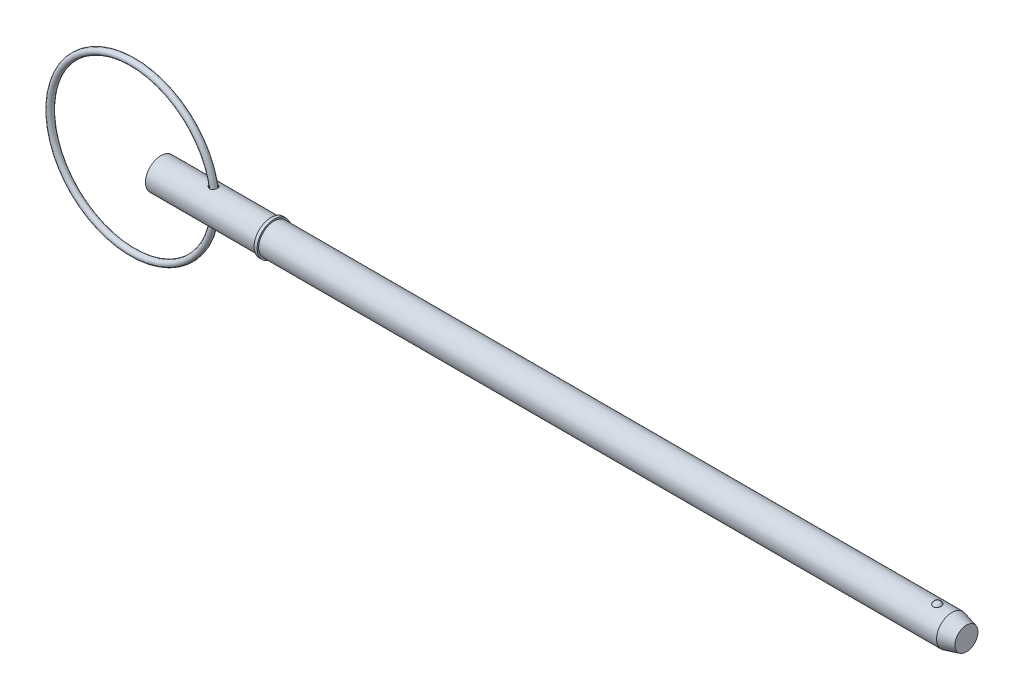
ISO-10303-21;
HEADER;
FILE_DESCRIPTION(('STEP AP214'),'2;1');
FILE_NAME('part.step','',(''),(''),'','','');
FILE_SCHEMA(('AUTOMOTIVE_DESIGN { 1 0 10303 214 1 1 1 1 }'));
ENDSEC;
DATA;
#1=APPLICATION_CONTEXT('core data for automotive mechanical design processes');
#2=APPLICATION_PROTOCOL_DEFINITION('international standard','automotive_design',2000,#1);
#3=PRODUCT_CONTEXT('',#1,'mechanical');
#4=PRODUCT('Part','Part','',(#3));
#5=PRODUCT_RELATED_PRODUCT_CATEGORY('part','',(#4));
#6=PRODUCT_DEFINITION_FORMATION('','',#4);
#7=PRODUCT_DEFINITION_CONTEXT('part definition',#1,'design');
#8=PRODUCT_DEFINITION('design','',#6,#7);
#9=PRODUCT_DEFINITION_SHAPE('','',#8);
#10=(LENGTH_UNIT() NAMED_UNIT(*) SI_UNIT(.MILLI.,.METRE.));
#11=(NAMED_UNIT(*) PLANE_ANGLE_UNIT() SI_UNIT($,.RADIAN.));
#12=(NAMED_UNIT(*) SI_UNIT($,.STERADIAN.) SOLID_ANGLE_UNIT());
#13=UNCERTAINTY_MEASURE_WITH_UNIT(LENGTH_MEASURE(1.E-05),#10,'distance_accuracy_value','');
#14=(GEOMETRIC_REPRESENTATION_CONTEXT(3) GLOBAL_UNCERTAINTY_ASSIGNED_CONTEXT((#13)) GLOBAL_UNIT_ASSIGNED_CONTEXT((#10,
#11,#12)) REPRESENTATION_CONTEXT('',''));
#15=CARTESIAN_POINT('',(0.,0.,0.));
#16=DIRECTION('',(0.,0.,1.));
#17=DIRECTION('',(1.,0.,0.));
#18=AXIS2_PLACEMENT_3D('',#15,#16,#17);
#19=CARTESIAN_POINT('',(-4.3552379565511,0.,0.));
#20=DIRECTION('',(0.,0.,1.));
#21=DIRECTION('',(1.,0.,0.));
#22=AXIS2_PLACEMENT_3D('',#19,#20,#21);
#23=TOROIDAL_SURFACE('',#22,12.7,0.476000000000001);
#24=CARTESIAN_POINT('',(8.8207620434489,0.,0.));
#25=VERTEX_POINT('',#24);
#26=VERTEX_LOOP('',#25);
#27=FACE_BOUND('',#26,.T.);
#28=ADVANCED_FACE('P0_F12',(#27),#23,.T.);
#29=CLOSED_SHELL('',(#28));
#30=MANIFOLD_SOLID_BREP('P0_B1',#29);
#31=CARTESIAN_POINT('',(0.,0.,0.));
#32=DIRECTION('',(1.,0.,0.));
#33=DIRECTION('',(0.,0.,-1.));
#34=AXIS2_PLACEMENT_3D('',#31,#32,#33);
#35=CYLINDRICAL_SURFACE('',#34,2.38);
#36=CARTESIAN_POINT('',(7.58975148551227,2.36313886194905,-0.28279801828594));
#37=CARTESIAN_POINT('',(7.6071494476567,2.3595137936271,-0.313086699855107));
#38=CARTESIAN_POINT('',(7.62722970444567,2.35548219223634,-0.341811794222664));
#39=CARTESIAN_POINT('',(7.6719764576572,2.34708028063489,-0.395416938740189));
#40=CARTESIAN_POINT('',(7.69665038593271,2.34270942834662,-0.420290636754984));
#41=CARTESIAN_POINT('',(7.74972661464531,2.33413422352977,-0.465561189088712));
#42=CARTESIAN_POINT('',(7.77811964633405,2.3299294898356,-0.485968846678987));
#43=CARTESIAN_POINT('',(7.83790446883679,2.32214293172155,-0.521911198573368));
#44=CARTESIAN_POINT('',(7.86929545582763,2.31856094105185,-0.537447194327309));
#45=CARTESIAN_POINT('',(7.93519088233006,2.31234960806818,-0.563583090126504));
#46=CARTESIAN_POINT('',(7.96975762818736,2.30974952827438,-0.574033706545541));
#47=CARTESIAN_POINT('',(8.04024488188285,2.3060008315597,-0.588914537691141));
#48=CARTESIAN_POINT('',(8.07616512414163,2.3048519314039,-0.593345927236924));
#49=CARTESIAN_POINT('',(8.14695871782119,2.30420789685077,-0.595841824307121));
#50=CARTESIAN_POINT('',(8.18182355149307,2.30465507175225,-0.594128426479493));
#51=CARTESIAN_POINT('',(8.25068512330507,2.30705630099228,-0.584734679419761));
#52=CARTESIAN_POINT('',(8.28468213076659,2.30900988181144,-0.577056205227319));
#53=CARTESIAN_POINT('',(8.34906698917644,2.31406811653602,-0.556412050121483));
#54=CARTESIAN_POINT('',(8.37955021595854,2.31711087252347,-0.543727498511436));
#55=CARTESIAN_POINT('',(8.43786372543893,2.32400968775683,-0.513438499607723));
#56=CARTESIAN_POINT('',(8.46569411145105,2.32786571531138,-0.495834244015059));
#57=CARTESIAN_POINT('',(8.51768626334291,2.33591620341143,-0.456393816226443));
#58=CARTESIAN_POINT('',(8.54188060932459,2.34010706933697,-0.434599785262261));
#59=CARTESIAN_POINT('',(8.58630752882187,2.34840208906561,-0.387277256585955));
#60=CARTESIAN_POINT('',(8.60653982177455,2.35250623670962,-0.361748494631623));
#61=CARTESIAN_POINT('',(8.64282785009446,2.36024850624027,-0.307237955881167));
#62=CARTESIAN_POINT('',(8.65881497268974,2.36387854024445,-0.278209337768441));
#63=CARTESIAN_POINT('',(8.68580879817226,2.37020506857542,-0.217827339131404));
#64=CARTESIAN_POINT('',(8.69681534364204,2.37290153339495,-0.18647388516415));
#65=CARTESIAN_POINT('',(8.71363969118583,2.37708738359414,-0.122079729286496));
#66=CARTESIAN_POINT('',(8.71941899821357,2.37856780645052,-0.0890283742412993));
#67=CARTESIAN_POINT('',(8.72550469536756,2.38012793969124,-0.0223933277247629));
#68=CARTESIAN_POINT('',(8.72581115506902,2.38020766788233,0.0111903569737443));
#69=CARTESIAN_POINT('',(8.72094957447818,2.37895941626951,0.0778527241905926));
#70=CARTESIAN_POINT('',(8.71579439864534,2.377634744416,0.110932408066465));
#71=CARTESIAN_POINT('',(8.70015845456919,2.37372548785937,0.175731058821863));
#72=CARTESIAN_POINT('',(8.68967753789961,2.37114086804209,0.207449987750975));
#73=CARTESIAN_POINT('',(8.66363496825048,2.36498751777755,0.268667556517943));
#74=CARTESIAN_POINT('',(8.64806773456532,2.36141770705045,0.298163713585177));
#75=CARTESIAN_POINT('',(8.61223946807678,2.35368505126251,0.354067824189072));
#76=CARTESIAN_POINT('',(8.59197833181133,2.34952219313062,0.380475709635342));
#77=CARTESIAN_POINT('',(8.54726357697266,2.34106443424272,0.429460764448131));
#78=CARTESIAN_POINT('',(8.52280850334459,2.33676948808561,0.452036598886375));
#79=CARTESIAN_POINT('',(8.47035669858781,2.3285376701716,0.49269040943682));
#80=CARTESIAN_POINT('',(8.44236041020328,2.32460075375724,0.510768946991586));
#81=CARTESIAN_POINT('',(8.38398546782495,2.31758529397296,0.541708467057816));
#82=CARTESIAN_POINT('',(8.35364184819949,2.31449641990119,0.554633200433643));
#83=CARTESIAN_POINT('',(8.29114127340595,2.30945817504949,0.575253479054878));
#84=CARTESIAN_POINT('',(8.25898451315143,2.30750868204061,0.582949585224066));
#85=CARTESIAN_POINT('',(8.19412910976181,2.30496641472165,0.592921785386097));
#86=CARTESIAN_POINT('',(8.161439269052,2.30436008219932,0.595252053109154));
#87=CARTESIAN_POINT('',(8.09610955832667,2.30450130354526,0.594704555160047));
#88=CARTESIAN_POINT('',(8.0634696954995,2.30524903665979,0.591826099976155));
#89=CARTESIAN_POINT('',(7.99825736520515,2.30802121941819,0.580921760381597));
#90=CARTESIAN_POINT('',(7.96570822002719,2.31007800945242,0.572765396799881));
#91=CARTESIAN_POINT('',(7.90235775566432,2.31524655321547,0.551500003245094));
#92=CARTESIAN_POINT('',(7.87155698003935,2.31835863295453,0.53838944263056));
#93=CARTESIAN_POINT('',(7.81084906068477,2.32548378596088,0.506755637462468));
#94=CARTESIAN_POINT('',(7.78107737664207,2.32953608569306,0.487980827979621));
#95=CARTESIAN_POINT('',(7.72506412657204,2.33797565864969,0.445793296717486));
#96=CARTESIAN_POINT('',(7.69882353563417,2.34236302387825,0.422379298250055));
#97=CARTESIAN_POINT('',(7.65019002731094,2.35106473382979,0.370927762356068));
#98=CARTESIAN_POINT('',(7.62788209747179,2.35537598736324,0.342808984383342));
#99=CARTESIAN_POINT('',(7.58861130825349,2.36331071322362,0.282967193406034));
#100=CARTESIAN_POINT('',(7.57164595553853,2.3669345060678,0.251245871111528));
#101=CARTESIAN_POINT('',(7.54465876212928,2.37284705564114,0.187017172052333));
#102=CARTESIAN_POINT('',(7.5342924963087,2.37520082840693,0.154660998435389));
#103=CARTESIAN_POINT('',(7.51954252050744,2.37858198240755,0.0885446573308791));
#104=CARTESIAN_POINT('',(7.51515589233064,2.37961001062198,0.0547851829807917));
#105=CARTESIAN_POINT('',(7.51270681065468,2.38018226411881,-0.0102367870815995));
#106=CARTESIAN_POINT('',(7.51416323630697,2.37983937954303,-0.0414812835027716));
#107=CARTESIAN_POINT('',(7.52225907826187,2.37796025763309,-0.103234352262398));
#108=CARTESIAN_POINT('',(7.52889419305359,2.37642501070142,-0.133743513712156));
#109=CARTESIAN_POINT('',(7.54430841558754,2.37294751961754,-0.184277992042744));
#110=CARTESIAN_POINT('',(7.55185254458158,2.37126438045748,-0.204709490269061));
#111=CARTESIAN_POINT('',(7.56916989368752,2.36748607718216,-0.244561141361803));
#112=CARTESIAN_POINT('',(7.57894307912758,2.36539091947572,-0.263981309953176));
#113=CARTESIAN_POINT('',(7.58975148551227,2.36313886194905,-0.28279801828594));
#114=B_SPLINE_CURVE_WITH_KNOTS('',3,(#36,#37,#38,#39,#40,#41,#42,#43,#44,#45,#46,#47,#48,#49,
#50,#51,#52,#53,#54,#55,#56,#57,#58,#59,#60,#61,#62,#63,#64,#65,#66,#67,#68,#69,#70,#71,#72,#73,
#74,#75,#76,#77,#78,#79,#80,#81,#82,#83,#84,#85,#86,#87,#88,#89,#90,#91,#92,#93,#94,#95,#96,#97,
#98,#99,#100,#101,#102,#103,#104,#105,#106,#107,#108,#109,#110,#111,#112,#113),.UNSPECIFIED.,
.T.,.F.,(4,2,2,2,2,2,2,2,2,2,2,2,2,2,2,2,2,2,2,2,2,2,2,2,2,2,2,2,2,2,2,2,2,2,2,2,2,2,4),(0.,
0.105267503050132,0.210706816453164,0.315888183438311,0.421041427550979,0.529118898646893,
0.637175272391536,0.741366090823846,0.84552417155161,0.944516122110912,1.04350421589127,
1.14154435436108,1.23959143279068,1.33913812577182,1.43868796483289,1.53896508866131,
1.63924093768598,1.73928111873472,1.83932408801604,1.93947719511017,2.03963250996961,
2.13982264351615,2.24000026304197,2.33889712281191,2.43778337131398,2.53566679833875,
2.63356318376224,2.73397729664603,2.83442245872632,2.94022921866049,3.04606513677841,
3.15396441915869,3.26181327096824,3.36343346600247,3.46500405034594,3.55839004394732,
3.65169855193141,3.71709653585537,3.78249350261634),.UNSPECIFIED.);
#115=CARTESIAN_POINT('',(7.58975148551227,2.36313886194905,-0.28279801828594));
#116=VERTEX_POINT('',#115);
#117=EDGE_CURVE('P1_E42',#116,#116,#114,.T.);
#118=ORIENTED_EDGE('',*,*,#117,.T.);
#119=EDGE_LOOP('',(#118));
#120=FACE_BOUND('',#119,.T.);
#121=CARTESIAN_POINT('',(0.,0.,0.));
#122=DIRECTION('',(1.,0.,0.));
#123=DIRECTION('',(0.,0.,-1.));
#124=AXIS2_PLACEMENT_3D('',#121,#122,#123);
#125=CIRCLE('',#124,2.38);
#126=CARTESIAN_POINT('',(0.,0.,-2.38));
#127=VERTEX_POINT('',#126);
#128=EDGE_CURVE('P1_E9',#127,#127,#125,.T.);
#129=ORIENTED_EDGE('',*,*,#128,.T.);
#130=EDGE_LOOP('',(#129));
#131=FACE_BOUND('',#130,.T.);
#132=CARTESIAN_POINT('',(16.974,0.,0.));
#133=DIRECTION('',(1.,0.,0.));
#134=DIRECTION('',(0.,0.,-1.));
#135=AXIS2_PLACEMENT_3D('',#132,#133,#134);
#136=CIRCLE('',#135,2.38);
#137=CARTESIAN_POINT('',(16.974,0.,-2.38));
#138=VERTEX_POINT('',#137);
#139=EDGE_CURVE('P1_E25',#138,#138,#136,.T.);
#140=ORIENTED_EDGE('',*,*,#139,.F.);
#141=EDGE_LOOP('',(#140));
#142=FACE_BOUND('',#141,.T.);
#143=CARTESIAN_POINT('',(7.58975148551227,-2.36313886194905,-0.28279801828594));
#144=CARTESIAN_POINT('',(7.57418830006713,-2.3663814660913,-0.255701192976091));
#145=CARTESIAN_POINT('',(7.56076205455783,-2.36930044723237,-0.227336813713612));
#146=CARTESIAN_POINT('',(7.53869583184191,-2.37419355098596,-0.168724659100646));
#147=CARTESIAN_POINT('',(7.53005409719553,-2.37616802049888,-0.138477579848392));
#148=CARTESIAN_POINT('',(7.5179268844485,-2.37895970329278,-0.0768369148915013));
#149=CARTESIAN_POINT('',(7.51445304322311,-2.37977430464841,-0.0454409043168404));
#150=CARTESIAN_POINT('',(7.51287156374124,-2.38014365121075,0.0174935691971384));
#151=CARTESIAN_POINT('',(7.51476360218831,-2.37969847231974,0.0490320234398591));
#152=CARTESIAN_POINT('',(7.52368198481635,-2.37763188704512,0.11036883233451));
#153=CARTESIAN_POINT('',(7.53055435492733,-2.37604576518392,0.140191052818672));
#154=CARTESIAN_POINT('',(7.54895588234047,-2.37190466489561,0.19828599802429));
#155=CARTESIAN_POINT('',(7.56048572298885,-2.36934954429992,0.226558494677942));
#156=CARTESIAN_POINT('',(7.58819257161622,-2.36343089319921,0.281762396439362));
#157=CARTESIAN_POINT('',(7.60450508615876,-2.36004434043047,0.308623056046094));
#158=CARTESIAN_POINT('',(7.64106334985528,-2.35283977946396,0.359451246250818));
#159=CARTESIAN_POINT('',(7.6613104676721,-2.34902162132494,0.383417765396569));
#160=CARTESIAN_POINT('',(7.70695754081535,-2.34099193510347,0.429832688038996));
#161=CARTESIAN_POINT('',(7.73264232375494,-2.33677362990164,0.45200004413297));
#162=CARTESIAN_POINT('',(7.78725305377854,-2.32868304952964,0.491988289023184));
#163=CARTESIAN_POINT('',(7.81618023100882,-2.32481090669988,0.509807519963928));
#164=CARTESIAN_POINT('',(7.87824201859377,-2.31763132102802,0.541539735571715));
#165=CARTESIAN_POINT('',(7.91152093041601,-2.31436703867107,0.555181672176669));
#166=CARTESIAN_POINT('',(7.97999150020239,-2.30909873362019,0.576703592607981));
#167=CARTESIAN_POINT('',(8.01518292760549,-2.30709455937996,0.584584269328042));
#168=CARTESIAN_POINT('',(8.08580757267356,-2.30465743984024,0.594119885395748));
#169=CARTESIAN_POINT('',(8.12122470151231,-2.30419653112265,0.595885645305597));
#170=CARTESIAN_POINT('',(8.19181659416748,-2.30486796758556,0.593284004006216));
#171=CARTESIAN_POINT('',(8.22699144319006,-2.30599972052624,0.588918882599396));
#172=CARTESIAN_POINT('',(8.29408987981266,-2.30963941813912,0.574470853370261));
#173=CARTESIAN_POINT('',(8.32608666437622,-2.31207030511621,0.564707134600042));
#174=CARTESIAN_POINT('',(8.38787213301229,-2.31798180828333,0.539927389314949));
#175=CARTESIAN_POINT('',(8.41766103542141,-2.32146232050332,0.524911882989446));
#176=CARTESIAN_POINT('',(8.47353661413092,-2.32898511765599,0.490439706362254));
#177=CARTESIAN_POINT('',(8.49969091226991,-2.33301318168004,0.471089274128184));
#178=CARTESIAN_POINT('',(8.54838372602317,-2.34124455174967,0.428307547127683));
#179=CARTESIAN_POINT('',(8.57092204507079,-2.34544786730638,0.404876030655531));
#180=CARTESIAN_POINT('',(8.61207557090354,-2.35362667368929,0.354267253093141));
#181=CARTESIAN_POINT('',(8.63063940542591,-2.35759874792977,0.3270476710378));
#182=CARTESIAN_POINT('',(8.66303816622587,-2.36482918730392,0.269839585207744));
#183=CARTESIAN_POINT('',(8.67687284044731,-2.36808751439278,0.23985093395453));
#184=CARTESIAN_POINT('',(8.69960621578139,-2.37357381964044,0.177579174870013));
#185=CARTESIAN_POINT('',(8.7084473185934,-2.3757897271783,0.145273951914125));
#186=CARTESIAN_POINT('',(8.72072898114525,-2.37889592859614,0.0795911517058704));
#187=CARTESIAN_POINT('',(8.72416959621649,-2.37978623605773,0.0462135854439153));
#188=CARTESIAN_POINT('',(8.72556332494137,-2.38014500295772,-0.0206284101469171));
#189=CARTESIAN_POINT('',(8.72352221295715,-2.37961495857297,-0.0540927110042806));
#190=CARTESIAN_POINT('',(8.71401607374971,-2.37719332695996,-0.12019135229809));
#191=CARTESIAN_POINT('',(8.70655097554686,-2.37530172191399,-0.152825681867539));
#192=CARTESIAN_POINT('',(8.68638818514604,-2.37036240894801,-0.216324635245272));
#193=CARTESIAN_POINT('',(8.67369312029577,-2.36731528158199,-0.247190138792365));
#194=CARTESIAN_POINT('',(8.64338307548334,-2.36039503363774,-0.306303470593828));
#195=CARTESIAN_POINT('',(8.62576790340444,-2.35652188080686,-0.334551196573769));
#196=CARTESIAN_POINT('',(8.58601062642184,-2.34836581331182,-0.387689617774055));
#197=CARTESIAN_POINT('',(8.56385884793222,-2.34408203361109,-0.412572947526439));
#198=CARTESIAN_POINT('',(8.51562034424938,-2.33559361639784,-0.458194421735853));
#199=CARTESIAN_POINT('',(8.4895339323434,-2.33138897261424,-0.478932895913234));
#200=CARTESIAN_POINT('',(8.43437902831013,-2.32357677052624,-0.515498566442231));
#201=CARTESIAN_POINT('',(8.40533919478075,-2.31996422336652,-0.531367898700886));
#202=CARTESIAN_POINT('',(8.3449114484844,-2.31370413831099,-0.557997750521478));
#203=CARTESIAN_POINT('',(8.31352388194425,-2.31105645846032,-0.568759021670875));
#204=CARTESIAN_POINT('',(8.24979053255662,-2.30704987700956,-0.584798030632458));
#205=CARTESIAN_POINT('',(8.2174653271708,-2.30567279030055,-0.590153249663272));
#206=CARTESIAN_POINT('',(8.15234941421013,-2.3042717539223,-0.595600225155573));
#207=CARTESIAN_POINT('',(8.11955868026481,-2.30424788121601,-0.595691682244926));
#208=CARTESIAN_POINT('',(8.05396041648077,-2.30553291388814,-0.590698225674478));
#209=CARTESIAN_POINT('',(8.02115865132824,-2.30685983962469,-0.585543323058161));
#210=CARTESIAN_POINT('',(7.95682322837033,-2.31069752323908,-0.570209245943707));
#211=CARTESIAN_POINT('',(7.9252899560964,-2.31320863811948,-0.560028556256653));
#212=CARTESIAN_POINT('',(7.86270639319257,-2.31927991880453,-0.534343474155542));
#213=CARTESIAN_POINT('',(7.83175966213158,-2.32288638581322,-0.51859766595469));
#214=CARTESIAN_POINT('',(7.7728658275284,-2.33068292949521,-0.48234820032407));
#215=CARTESIAN_POINT('',(7.74491930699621,-2.33487311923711,-0.461843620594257));
#216=CARTESIAN_POINT('',(7.69322838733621,-2.34330635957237,-0.416926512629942));
#217=CARTESIAN_POINT('',(7.66941974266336,-2.34754724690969,-0.392587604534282));
#218=CARTESIAN_POINT('',(7.62614930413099,-2.35569931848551,-0.340264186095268));
#219=CARTESIAN_POINT('',(7.60668542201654,-2.35961066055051,-0.312281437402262));
#220=CARTESIAN_POINT('',(7.58975148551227,-2.36313886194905,-0.28279801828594));
#221=B_SPLINE_CURVE_WITH_KNOTS('',3,(#143,#144,#145,#146,#147,#148,#149,#150,#151,#152,#153,
#154,#155,#156,#157,#158,#159,#160,#161,#162,#163,#164,#165,#166,#167,#168,#169,#170,#171,#172,
#173,#174,#175,#176,#177,#178,#179,#180,#181,#182,#183,#184,#185,#186,#187,#188,#189,#190,#191,
#192,#193,#194,#195,#196,#197,#198,#199,#200,#201,#202,#203,#204,#205,#206,#207,#208,#209,#210,
#211,#212,#213,#214,#215,#216,#217,#218,#219,#220),.UNSPECIFIED.,.T.,.F.,(4,2,2,2,2,2,2,2,2,2,2,
2,2,2,2,2,2,2,2,2,2,2,2,2,2,2,2,2,2,2,2,2,2,2,2,2,2,2,4),(0.,0.0941407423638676,
0.188246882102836,0.282564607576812,0.376876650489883,0.468390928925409,0.559918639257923,
0.654342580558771,0.748799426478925,0.850921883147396,0.953083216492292,1.06090345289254,
1.16871071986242,1.2745536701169,1.38035727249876,1.48048681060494,1.58060643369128,
1.67849861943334,1.7763961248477,1.87549138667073,1.97459192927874,2.07481335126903,
2.17503374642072,2.27514861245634,2.37526478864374,2.47533073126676,2.57540058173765,
2.67568607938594,2.77596359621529,2.87534713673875,2.97471604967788,3.07263964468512,
3.17056880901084,3.26982174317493,3.36910461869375,3.47336737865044,3.57765036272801,
3.68013205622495,3.78256438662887),.UNSPECIFIED.);
#222=CARTESIAN_POINT('',(7.58975148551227,-2.36313886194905,-0.28279801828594));
#223=VERTEX_POINT('',#222);
#224=EDGE_CURVE('P1_E17',#223,#223,#221,.T.);
#225=ORIENTED_EDGE('',*,*,#224,.T.);
#226=EDGE_LOOP('',(#225));
#227=FACE_BOUND('',#226,.T.);
#228=ADVANCED_FACE('P1_F13',(#120,#131,#142,#227),#35,.T.);
#229=CARTESIAN_POINT('',(0.,0.,0.));
#230=DIRECTION('',(1.,0.,0.));
#231=DIRECTION('',(0.,0.,-1.));
#232=AXIS2_PLACEMENT_3D('',#229,#230,#231);
#233=CYLINDRICAL_SURFACE('',#232,2.38);
#234=CARTESIAN_POINT('',(121.909429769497,0.,0.));
#235=DIRECTION('',(1.,0.,0.));
#236=DIRECTION('',(0.,0.,-1.));
#237=AXIS2_PLACEMENT_3D('',#234,#235,#236);
#238=CIRCLE('',#237,2.38);
#239=CARTESIAN_POINT('',(121.909429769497,0.,-2.38));
#240=VERTEX_POINT('',#239);
#241=EDGE_CURVE('P1_E99',#240,#240,#238,.T.);
#242=ORIENTED_EDGE('',*,*,#241,.F.);
#243=EDGE_LOOP('',(#242));
#244=FACE_BOUND('',#243,.T.);
#245=CARTESIAN_POINT('',(17.45,0.,0.));
#246=DIRECTION('',(1.,0.,0.));
#247=DIRECTION('',(0.,0.,-1.));
#248=AXIS2_PLACEMENT_3D('',#245,#246,#247);
#249=CIRCLE('',#248,2.38);
#250=CARTESIAN_POINT('',(17.45,0.,-2.38));
#251=VERTEX_POINT('',#250);
#252=EDGE_CURVE('P1_E96',#251,#251,#249,.T.);
#253=ORIENTED_EDGE('',*,*,#252,.T.);
#254=EDGE_LOOP('',(#253));
#255=FACE_BOUND('',#254,.T.);
#256=CARTESIAN_POINT('',(119.663449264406,2.2921568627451,0.640637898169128));
#257=CARTESIAN_POINT('',(119.630355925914,2.29215737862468,0.640637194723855));
#258=CARTESIAN_POINT('',(119.597254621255,2.29293179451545,0.637884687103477));
#259=CARTESIAN_POINT('',(119.532017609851,2.29594030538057,0.626968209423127));
#260=CARTESIAN_POINT('',(119.499882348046,2.29817506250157,0.618801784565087));
#261=CARTESIAN_POINT('',(119.437540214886,2.30384308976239,0.597351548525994));
#262=CARTESIAN_POINT('',(119.40733051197,2.30727454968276,0.584075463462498));
#263=CARTESIAN_POINT('',(119.349567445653,2.31495941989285,0.552829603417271));
#264=CARTESIAN_POINT('',(119.32201418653,2.31921286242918,0.534859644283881));
#265=CARTESIAN_POINT('',(119.269593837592,2.32820213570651,0.494282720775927));
#266=CARTESIAN_POINT('',(119.244805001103,2.33294694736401,0.471576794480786));
#267=CARTESIAN_POINT('',(119.199216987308,2.34234144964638,0.422446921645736));
#268=CARTESIAN_POINT('',(119.178418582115,2.34699112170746,0.396022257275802));
#269=CARTESIAN_POINT('',(119.14035804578,2.35593942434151,0.338855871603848));
#270=CARTESIAN_POINT('',(119.123305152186,2.36021170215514,0.307970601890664));
#271=CARTESIAN_POINT('',(119.0943607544,2.3677057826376,0.243750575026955));
#272=CARTESIAN_POINT('',(119.0824701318,2.37092740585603,0.210415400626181));
#273=CARTESIAN_POINT('',(119.063807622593,2.37606901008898,0.141189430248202));
#274=CARTESIAN_POINT('',(119.057195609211,2.37794816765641,0.105252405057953));
#275=CARTESIAN_POINT('',(119.049809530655,2.38005135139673,0.0327351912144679));
#276=CARTESIAN_POINT('',(119.049035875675,2.38027526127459,-0.00384504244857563));
#277=CARTESIAN_POINT('',(119.053362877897,2.37903842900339,-0.076983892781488));
#278=CARTESIAN_POINT('',(119.05852028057,2.37756141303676,-0.113538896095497));
#279=CARTESIAN_POINT('',(119.074701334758,2.37305303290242,-0.185229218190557));
#280=CARTESIAN_POINT('',(119.085725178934,2.37002161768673,-0.220364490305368));
#281=CARTESIAN_POINT('',(119.113397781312,2.36273722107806,-0.288156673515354));
#282=CARTESIAN_POINT('',(119.130038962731,2.35848588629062,-0.320816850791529));
#283=CARTESIAN_POINT('',(119.168598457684,2.34923130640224,-0.382744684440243));
#284=CARTESIAN_POINT('',(119.190516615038,2.34422808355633,-0.412012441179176));
#285=CARTESIAN_POINT('',(119.238754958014,2.33412555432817,-0.46583000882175));
#286=CARTESIAN_POINT('',(119.265002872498,2.32902887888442,-0.490444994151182));
#287=CARTESIAN_POINT('',(119.321476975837,2.31926941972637,-0.534700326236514));
#288=CARTESIAN_POINT('',(119.351702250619,2.3146065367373,-0.554341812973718));
#289=CARTESIAN_POINT('',(119.414061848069,2.30645675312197,-0.587312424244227));
#290=CARTESIAN_POINT('',(119.446078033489,2.30293152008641,-0.600855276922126));
#291=CARTESIAN_POINT('',(119.512079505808,2.29725171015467,-0.622220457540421));
#292=CARTESIAN_POINT('',(119.546064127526,2.29509667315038,-0.630044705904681));
#293=CARTESIAN_POINT('',(119.613299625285,2.29249264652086,-0.639452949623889));
#294=CARTESIAN_POINT('',(119.646508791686,2.29196755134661,-0.641315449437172));
#295=CARTESIAN_POINT('',(119.712763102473,2.29246849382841,-0.639522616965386));
#296=CARTESIAN_POINT('',(119.745808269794,2.29349430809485,-0.635868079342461));
#297=CARTESIAN_POINT('',(119.810102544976,2.29694059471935,-0.623301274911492));
#298=CARTESIAN_POINT('',(119.841374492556,2.29933234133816,-0.61449721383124));
#299=CARTESIAN_POINT('',(119.901995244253,2.30522511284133,-0.592006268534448));
#300=CARTESIAN_POINT('',(119.931343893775,2.30872622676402,-0.57831899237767));
#301=CARTESIAN_POINT('',(119.988036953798,2.31655795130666,-0.546112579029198));
#302=CARTESIAN_POINT('',(120.015320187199,2.32090569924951,-0.527490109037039));
#303=CARTESIAN_POINT('',(120.066490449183,2.32992206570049,-0.48611785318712));
#304=CARTESIAN_POINT('',(120.090376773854,2.33459075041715,-0.46336721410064));
#305=CARTESIAN_POINT('',(120.135272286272,2.34399834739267,-0.413220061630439));
#306=CARTESIAN_POINT('',(120.156097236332,2.34873051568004,-0.385657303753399));
#307=CARTESIAN_POINT('',(120.193056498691,2.35754932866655,-0.327455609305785));
#308=CARTESIAN_POINT('',(120.209189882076,2.36163584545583,-0.296816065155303));
#309=CARTESIAN_POINT('',(120.2369822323,2.36889321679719,-0.232047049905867));
#310=CARTESIAN_POINT('',(120.248445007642,2.37202275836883,-0.197828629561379));
#311=CARTESIAN_POINT('',(120.265752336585,2.37681926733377,-0.12790042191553));
#312=CARTESIAN_POINT('',(120.271596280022,2.37848607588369,-0.0921904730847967));
#313=CARTESIAN_POINT('',(120.277605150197,2.38020024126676,-0.0196348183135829));
#314=CARTESIAN_POINT('',(120.27767043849,2.38021918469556,0.0172198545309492));
#315=CARTESIAN_POINT('',(120.271868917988,2.37856356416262,0.0904219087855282));
#316=CARTESIAN_POINT('',(120.266001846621,2.37688892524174,0.126769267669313));
#317=CARTESIAN_POINT('',(120.248425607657,2.37201688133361,0.19802859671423));
#318=CARTESIAN_POINT('',(120.236699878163,2.36881516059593,0.232936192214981));
#319=CARTESIAN_POINT('',(120.20763544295,2.36123444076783,0.300196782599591));
#320=CARTESIAN_POINT('',(120.190296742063,2.3568554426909,0.332549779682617));
#321=CARTESIAN_POINT('',(120.150535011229,2.34744667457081,0.393495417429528));
#322=CARTESIAN_POINT('',(120.128152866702,2.34242227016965,0.422115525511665));
#323=CARTESIAN_POINT('',(120.078739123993,2.33227293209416,0.475004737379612));
#324=CARTESIAN_POINT('',(120.051707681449,2.32714800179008,0.499273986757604));
#325=CARTESIAN_POINT('',(119.994498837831,2.31755359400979,0.542046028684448));
#326=CARTESIAN_POINT('',(119.96442973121,2.31306986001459,0.560690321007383));
#327=CARTESIAN_POINT('',(119.901386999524,2.3051412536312,0.592447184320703));
#328=CARTESIAN_POINT('',(119.868415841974,2.30169550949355,0.605564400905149));
#329=CARTESIAN_POINT('',(119.806842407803,2.29677744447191,0.623927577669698));
#330=CARTESIAN_POINT('',(119.778555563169,2.29505839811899,0.630178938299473));
#331=CARTESIAN_POINT('',(119.721330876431,2.29274795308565,0.638534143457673));
#332=CARTESIAN_POINT('',(119.692393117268,2.29215641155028,0.64063851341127));
#333=CARTESIAN_POINT('',(119.663449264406,2.2921568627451,0.640637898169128));
#334=B_SPLINE_CURVE_WITH_KNOTS('',3,(#256,#257,#258,#259,#260,#261,#262,#263,#264,#265,#266,
#267,#268,#269,#270,#271,#272,#273,#274,#275,#276,#277,#278,#279,#280,#281,#282,#283,#284,#285,
#286,#287,#288,#289,#290,#291,#292,#293,#294,#295,#296,#297,#298,#299,#300,#301,#302,#303,#304,
#305,#306,#307,#308,#309,#310,#311,#312,#313,#314,#315,#316,#317,#318,#319,#320,#321,#322,#323,
#324,#325,#326,#327,#328,#329,#330,#331,#332,#333),.UNSPECIFIED.,.T.,.F.,(4,2,2,2,2,2,2,2,2,2,2,
2,2,2,2,2,2,2,2,2,2,2,2,2,2,2,2,2,2,2,2,2,2,2,2,2,2,2,4),(0.,0.0991724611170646,
0.198389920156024,0.297457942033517,0.396529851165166,0.497927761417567,0.599345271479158,
0.705475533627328,0.811623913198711,0.92087671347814,1.03013718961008,1.1404517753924,
1.25076998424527,1.3609399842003,1.47110672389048,1.57959248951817,1.68805336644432,
1.79234266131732,1.89659691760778,1.99590391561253,2.0951966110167,2.19247425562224,
2.28975970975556,2.38926978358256,2.48880044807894,2.5929358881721,2.69709193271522,
2.80525821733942,2.91343624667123,3.02347917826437,3.13352698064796,3.24388765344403,
3.35424823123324,3.46374443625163,3.57323697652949,3.67968690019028,3.78604717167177,
3.87279565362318,3.9595331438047),.UNSPECIFIED.);
#335=CARTESIAN_POINT('',(119.663449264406,2.2921568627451,0.640637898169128));
#336=VERTEX_POINT('',#335);
#337=EDGE_CURVE('P1_E34',#336,#336,#334,.T.);
#338=ORIENTED_EDGE('',*,*,#337,.T.);
#339=EDGE_LOOP('',(#338));
#340=FACE_BOUND('',#339,.T.);
#341=ADVANCED_FACE('P1_F46',(#244,#255,#340),#233,.T.);
#342=CARTESIAN_POINT('',(0.,0.,0.));
#343=DIRECTION('',(-1.,0.,0.));
#344=DIRECTION('',(0.,0.,1.));
#345=AXIS2_PLACEMENT_3D('',#342,#343,#344);
#346=PLANE('',#345);
#347=ORIENTED_EDGE('',*,*,#128,.F.);
#348=EDGE_LOOP('',(#347));
#349=FACE_BOUND('',#348,.T.);
#350=ADVANCED_FACE('P1_F15',(#349),#346,.T.);
#351=CARTESIAN_POINT('',(16.974,2.38,0.));
#352=DIRECTION('',(-1.,0.,0.));
#353=DIRECTION('',(0.,0.,1.));
#354=AXIS2_PLACEMENT_3D('',#351,#352,#353);
#355=PLANE('',#354);
#356=ORIENTED_EDGE('',*,*,#139,.T.);
#357=EDGE_LOOP('',(#356));
#358=FACE_BOUND('',#357,.T.);
#359=CARTESIAN_POINT('',(16.974,0.,0.));
#360=DIRECTION('',(1.,0.,0.));
#361=DIRECTION('',(0.,0.,-1.));
#362=AXIS2_PLACEMENT_3D('',#359,#360,#361);
#363=CIRCLE('',#362,2.618);
#364=CARTESIAN_POINT('',(16.974,0.,-2.618));
#365=VERTEX_POINT('',#364);
#366=EDGE_CURVE('P1_E30',#365,#365,#363,.T.);
#367=ORIENTED_EDGE('',*,*,#366,.F.);
#368=EDGE_LOOP('',(#367));
#369=FACE_BOUND('',#368,.T.);
#370=ADVANCED_FACE('P1_F81',(#358,#369),#355,.T.);
#371=CARTESIAN_POINT('',(0.,0.,0.));
#372=DIRECTION('',(1.,0.,0.));
#373=DIRECTION('',(0.,0.,-1.));
#374=AXIS2_PLACEMENT_3D('',#371,#372,#373);
#375=CYLINDRICAL_SURFACE('',#374,2.618);
#376=ORIENTED_EDGE('',*,*,#366,.T.);
#377=EDGE_LOOP('',(#376));
#378=FACE_BOUND('',#377,.T.);
#379=CARTESIAN_POINT('',(17.45,0.,0.));
#380=DIRECTION('',(1.,0.,0.));
#381=DIRECTION('',(0.,0.,-1.));
#382=AXIS2_PLACEMENT_3D('',#379,#380,#381);
#383=CIRCLE('',#382,2.618);
#384=CARTESIAN_POINT('',(17.45,0.,-2.618));
#385=VERTEX_POINT('',#384);
#386=EDGE_CURVE('P1_E95',#385,#385,#383,.T.);
#387=ORIENTED_EDGE('',*,*,#386,.F.);
#388=EDGE_LOOP('',(#387));
#389=FACE_BOUND('',#388,.T.);
#390=ADVANCED_FACE('P1_F68',(#378,#389),#375,.T.);
#391=CARTESIAN_POINT('',(17.45,2.618,0.));
#392=DIRECTION('',(1.,0.,0.));
#393=DIRECTION('',(0.,0.,-1.));
#394=AXIS2_PLACEMENT_3D('',#391,#392,#393);
#395=PLANE('',#394);
#396=ORIENTED_EDGE('',*,*,#386,.T.);
#397=EDGE_LOOP('',(#396));
#398=FACE_BOUND('',#397,.T.);
#399=ORIENTED_EDGE('',*,*,#252,.F.);
#400=EDGE_LOOP('',(#399));
#401=FACE_BOUND('',#400,.T.);
#402=ADVANCED_FACE('P1_F62',(#398,#401),#395,.T.);
#403=CARTESIAN_POINT('',(124.13,0.,0.));
#404=DIRECTION('',(-1.,0.,0.));
#405=DIRECTION('',(0.,0.,1.));
#406=AXIS2_PLACEMENT_3D('',#403,#404,#405);
#407=CONICAL_SURFACE('',#406,1.78500000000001,0.261799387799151);
#408=ORIENTED_EDGE('',*,*,#241,.T.);
#409=EDGE_LOOP('',(#408));
#410=FACE_BOUND('',#409,.T.);
#411=CARTESIAN_POINT('',(124.13,0.,0.));
#412=DIRECTION('',(1.,0.,0.));
#413=DIRECTION('',(0.,0.,-1.));
#414=AXIS2_PLACEMENT_3D('',#411,#412,#413);
#415=CIRCLE('',#414,1.78500000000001);
#416=CARTESIAN_POINT('',(124.13,0.,-1.78500000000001));
#417=VERTEX_POINT('',#416);
#418=EDGE_CURVE('P1_E41',#417,#417,#415,.T.);
#419=ORIENTED_EDGE('',*,*,#418,.F.);
#420=EDGE_LOOP('',(#419));
#421=FACE_BOUND('',#420,.T.);
#422=ADVANCED_FACE('P1_F59',(#410,#421),#407,.T.);
#423=CARTESIAN_POINT('',(124.13,1.78500000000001,0.));
#424=DIRECTION('',(1.,0.,0.));
#425=DIRECTION('',(0.,0.,-1.));
#426=AXIS2_PLACEMENT_3D('',#423,#424,#425);
#427=PLANE('',#426);
#428=ORIENTED_EDGE('',*,*,#418,.T.);
#429=EDGE_LOOP('',(#428));
#430=FACE_BOUND('',#429,.T.);
#431=ADVANCED_FACE('P1_F55',(#430),#427,.T.);
#432=CARTESIAN_POINT('',(119.663449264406,2.142,0.));
#433=DIRECTION('',(-1.,0.,0.));
#434=DIRECTION('',(0.,1.,0.));
#435=AXIS2_PLACEMENT_3D('',#432,#433,#434);
#436=SPHERICAL_SURFACE('',#435,0.658000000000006);
#437=ORIENTED_EDGE('',*,*,#337,.F.);
#438=EDGE_LOOP('',(#437));
#439=FACE_BOUND('',#438,.T.);
#440=ADVANCED_FACE('P1_F50',(#439),#436,.T.);
#441=CARTESIAN_POINT('',(-4.3552379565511,0.,0.));
#442=DIRECTION('',(0.,0.,1.));
#443=DIRECTION('',(1.,0.,0.));
#444=AXIS2_PLACEMENT_3D('',#441,#442,#443);
#445=TOROIDAL_SURFACE('',#444,12.7,0.594999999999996);
#446=ORIENTED_EDGE('',*,*,#224,.F.);
#447=EDGE_LOOP('',(#446));
#448=FACE_BOUND('',#447,.T.);
#449=ORIENTED_EDGE('',*,*,#117,.F.);
#450=EDGE_LOOP('',(#449));
#451=FACE_BOUND('',#450,.T.);
#452=ADVANCED_FACE('P1_F54',(#448,#451),#445,.F.);
#453=CLOSED_SHELL('',(#228,#341,#350,#370,#390,#402,#422,#431,#440,#452));
#454=MANIFOLD_SOLID_BREP('P1_B1',#453);
#455=ADVANCED_BREP_SHAPE_REPRESENTATION('',(#18,#30,#454),#14);
#456=SHAPE_DEFINITION_REPRESENTATION(#9,#455);
ENDSEC;
END-ISO-10303-21;
